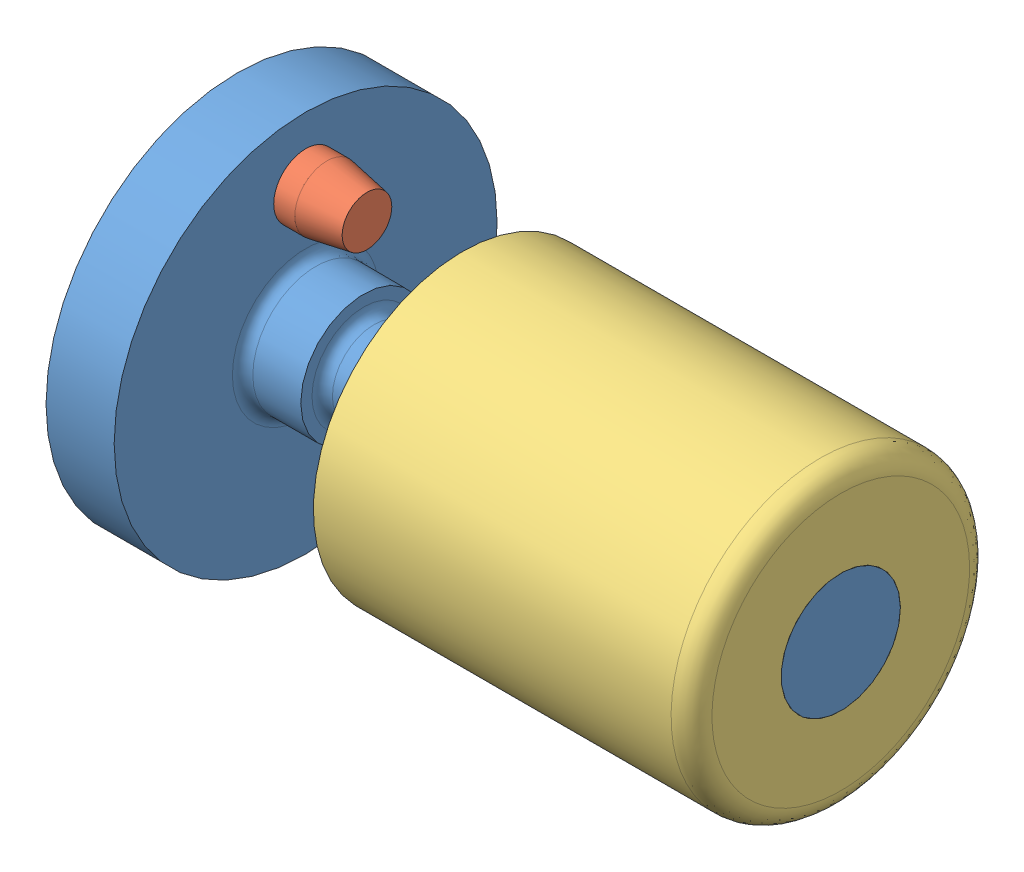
SolidWorks assembly DETENT ASSY.SLDASM, configuration Default (file format 11000). Lengths in mm.
Overall size (22.49 14.27 14.27).
3 component instances, 3 part files, 4 mates.
Components (placement in the parent):
- PLUNGER DETENT 7790009-1: PLUNGER DETENT 7790009.SLDPRT [Default] at (-19.0945 28.7106 -16.2653) size (22.49 14.27 14.27)
- PIN DETENT 7790027-1: PIN DETENT 7790027.SLDPRT [Default] at (-19.0945 33.4731 -16.2653) size (4.83 2.38 2.38)
- HOUSING DETENT SPRING 7790016-1: HOUSING DETENT SPRING 7790016.SLDPRT [Default] at (3.3922 28.7106 -16.2653) x (-1 0 0) z (0 -0.958418 -0.285368) size (14.1 11.13 11.13)
Mates (geometry in assembly coordinates):
- Concentric1: concentric: cylinder of PLUNGER DETENT 7790009-1 through (-19.0955 33.4731 -16.2653) axis (1 0 0) radius 1.19; cylinder of PIN DETENT 7790027-1 through (-19.0945 33.4731 -16.2653) axis (-1 0 0) radius 1.19
- Coincident1: coincident: plane of PLUNGER DETENT 7790009-1 through (-19.0945 28.7106 -16.2653) normal (-1 0 0); plane of PIN DETENT 7790027-1 through (-19.0945 33.4731 -16.2653) normal (-1 0 0)
- Concentric3: concentric: cylinder of PLUNGER DETENT 7790009-1 through (-19.0945 28.7106 -16.2653) axis (-1 0 0) radius 1.5494; cylinder of HOUSING DETENT SPRING 7790016-1 through (-10.7058 28.7106 -16.2653) axis (1 0 0) radius 1.5875
- Coincident3: coincident: cone of PLUNGER DETENT 7790009-1 through (3.3922 28.7106 -16.2653) axis (-1 0 0); cone of HOUSING DETENT SPRING 7790016-1 through (2.7572 28.7106 -16.2653) axis (-1 0 0)
